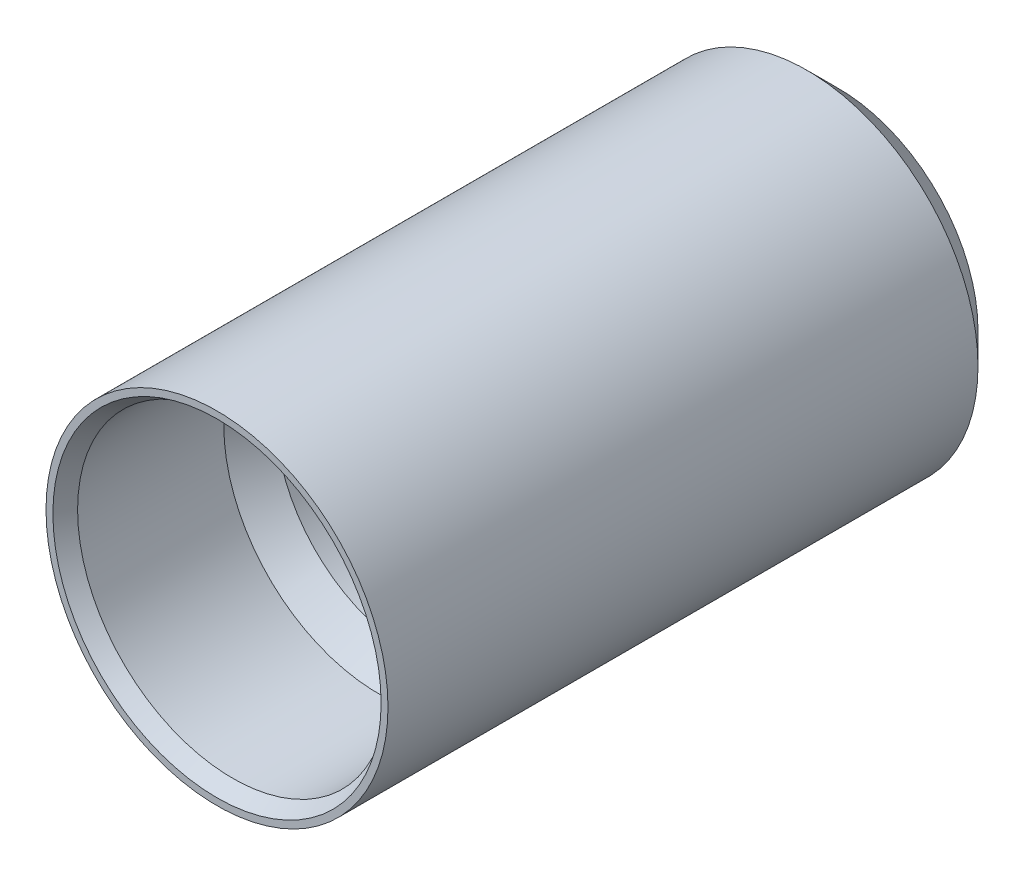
from build123d import *


with BuildPart() as part:
    # Sketch1 → Revolve1 (revolve)
    with BuildSketch(Plane(origin=(0, 0, 0), x_dir=(0, 0, -1), z_dir=(1, 0, 0)), mode=Mode.PRIVATE) as revolve1_sk:
        Polygon((0, 16.637), (57.404, 16.637), (60.452, 13.589), (60.452, 0), (55.688167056, 0), (47.752, 13.208), (35.07232, 13.208), (35.052, 13.22832), (18.968367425, 13.22832), (15.748, 15.0876), (1.524, 15.0876), (0, 15.96748181), align=None)
    revolve(revolve1_sk.sketch.rotate(Axis((0, 0, 7.996296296), (0, 0, -1)), 90), axis=Axis((0, 0, 7.996296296), (0, 0, -1)))


solid = part.part
